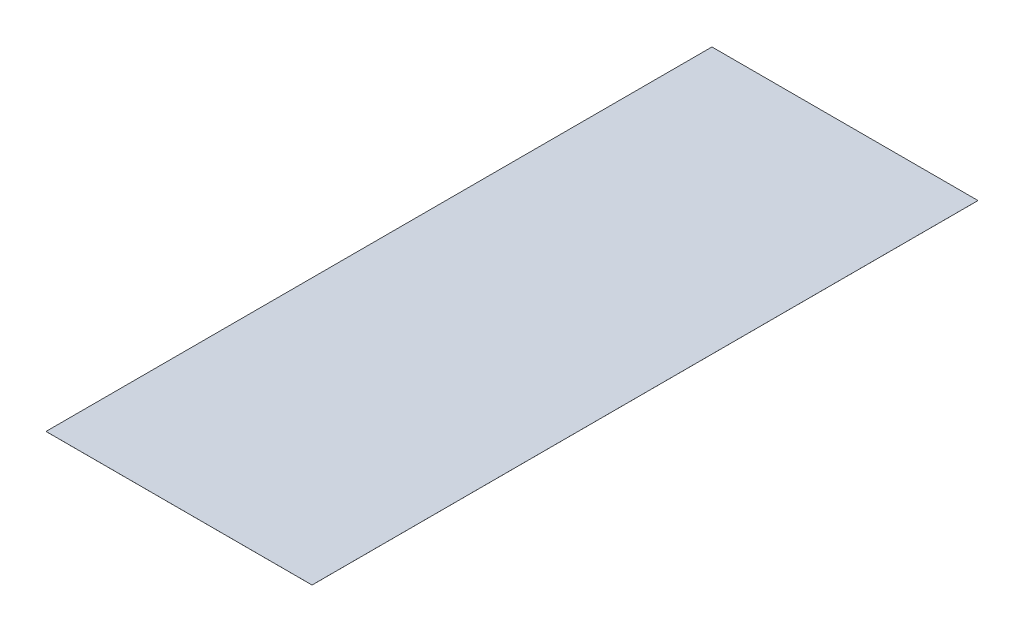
ISO-10303-21;
HEADER;
FILE_DESCRIPTION(('STEP AP214'),'2;1');
FILE_NAME('part.step','',(''),(''),'','','');
FILE_SCHEMA(('AUTOMOTIVE_DESIGN { 1 0 10303 214 1 1 1 1 }'));
ENDSEC;
DATA;
#1=APPLICATION_CONTEXT('core data for automotive mechanical design processes');
#2=APPLICATION_PROTOCOL_DEFINITION('international standard','automotive_design',2000,#1);
#3=PRODUCT_CONTEXT('',#1,'mechanical');
#4=PRODUCT('Part','Part','',(#3));
#5=PRODUCT_RELATED_PRODUCT_CATEGORY('part','',(#4));
#6=PRODUCT_DEFINITION_FORMATION('','',#4);
#7=PRODUCT_DEFINITION_CONTEXT('part definition',#1,'design');
#8=PRODUCT_DEFINITION('design','',#6,#7);
#9=PRODUCT_DEFINITION_SHAPE('','',#8);
#10=(LENGTH_UNIT() NAMED_UNIT(*) SI_UNIT(.MILLI.,.METRE.));
#11=(NAMED_UNIT(*) PLANE_ANGLE_UNIT() SI_UNIT($,.RADIAN.));
#12=(NAMED_UNIT(*) SI_UNIT($,.STERADIAN.) SOLID_ANGLE_UNIT());
#13=UNCERTAINTY_MEASURE_WITH_UNIT(LENGTH_MEASURE(1.E-05),#10,'distance_accuracy_value','');
#14=(GEOMETRIC_REPRESENTATION_CONTEXT(3) GLOBAL_UNCERTAINTY_ASSIGNED_CONTEXT((#13)) GLOBAL_UNIT_ASSIGNED_CONTEXT((#10,
#11,#12)) REPRESENTATION_CONTEXT('',''));
#15=CARTESIAN_POINT('',(0.,0.,0.));
#16=DIRECTION('',(0.,0.,1.));
#17=DIRECTION('',(1.,0.,0.));
#18=AXIS2_PLACEMENT_3D('',#15,#16,#17);
#19=CARTESIAN_POINT('',(-2000.,0.49999999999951,10012.49));
#20=DIRECTION('',(1.,0.,0.));
#21=DIRECTION('',(0.,0.,-1.));
#22=AXIS2_PLACEMENT_3D('',#19,#20,#21);
#23=PLANE('',#22);
#24=DIRECTION('',(0.,-1.,0.));
#25=VECTOR('',#24,1.);
#26=CARTESIAN_POINT('',(-2000.,0.49999999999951,0.));
#27=LINE('',#26,#25);
#28=CARTESIAN_POINT('',(-2000.,0.49999999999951,0.));
#29=VERTEX_POINT('',#28);
#30=CARTESIAN_POINT('',(-2000.,0.,0.));
#31=VERTEX_POINT('',#30);
#32=EDGE_CURVE('E101',#29,#31,#27,.T.);
#33=ORIENTED_EDGE('',*,*,#32,.T.);
#34=DIRECTION('',(0.,0.,-1.));
#35=VECTOR('',#34,1.);
#36=CARTESIAN_POINT('',(-2000.,0.,10012.49));
#37=LINE('',#36,#35);
#38=CARTESIAN_POINT('',(-2000.,0.,10012.49));
#39=VERTEX_POINT('',#38);
#40=EDGE_CURVE('E11',#39,#31,#37,.T.);
#41=ORIENTED_EDGE('',*,*,#40,.F.);
#42=DIRECTION('',(0.,-1.,0.));
#43=VECTOR('',#42,1.);
#44=CARTESIAN_POINT('',(-2000.,0.49999999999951,10012.49));
#45=LINE('',#44,#43);
#46=CARTESIAN_POINT('',(-2000.,0.49999999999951,10012.49));
#47=VERTEX_POINT('',#46);
#48=EDGE_CURVE('E89',#47,#39,#45,.T.);
#49=ORIENTED_EDGE('',*,*,#48,.F.);
#50=DIRECTION('',(0.,0.,-1.));
#51=VECTOR('',#50,1.);
#52=CARTESIAN_POINT('',(-2000.,0.49999999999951,10012.49));
#53=LINE('',#52,#51);
#54=EDGE_CURVE('E97',#47,#29,#53,.T.);
#55=ORIENTED_EDGE('',*,*,#54,.T.);
#56=EDGE_LOOP('',(#33,#41,#49,#55));
#57=FACE_BOUND('',#56,.T.);
#58=ADVANCED_FACE('F38',(#57),#23,.F.);
#59=CARTESIAN_POINT('',(-2000.,0.,10012.49));
#60=DIRECTION('',(0.,1.,0.));
#61=DIRECTION('',(-1.,0.,0.));
#62=AXIS2_PLACEMENT_3D('',#59,#60,#61);
#63=PLANE('',#62);
#64=DIRECTION('',(1.,0.,0.));
#65=VECTOR('',#64,1.);
#66=CARTESIAN_POINT('',(-2000.,0.,0.));
#67=LINE('',#66,#65);
#68=CARTESIAN_POINT('',(2000.,0.,0.));
#69=VERTEX_POINT('',#68);
#70=EDGE_CURVE('E93',#31,#69,#67,.T.);
#71=ORIENTED_EDGE('',*,*,#70,.T.);
#72=DIRECTION('',(0.,0.,-1.));
#73=VECTOR('',#72,1.);
#74=CARTESIAN_POINT('',(2000.,0.,10012.49));
#75=LINE('',#74,#73);
#76=CARTESIAN_POINT('',(2000.,0.,10012.49));
#77=VERTEX_POINT('',#76);
#78=EDGE_CURVE('E46',#77,#69,#75,.T.);
#79=ORIENTED_EDGE('',*,*,#78,.F.);
#80=DIRECTION('',(1.,0.,0.));
#81=VECTOR('',#80,1.);
#82=CARTESIAN_POINT('',(-2000.,0.,10012.49));
#83=LINE('',#82,#81);
#84=EDGE_CURVE('E84',#39,#77,#83,.T.);
#85=ORIENTED_EDGE('',*,*,#84,.F.);
#86=ORIENTED_EDGE('',*,*,#40,.T.);
#87=EDGE_LOOP('',(#71,#79,#85,#86));
#88=FACE_BOUND('',#87,.T.);
#89=ADVANCED_FACE('F92',(#88),#63,.F.);
#90=CARTESIAN_POINT('',(2000.,0.,10012.49));
#91=DIRECTION('',(-1.,0.,0.));
#92=DIRECTION('',(0.,0.,1.));
#93=AXIS2_PLACEMENT_3D('',#90,#91,#92);
#94=PLANE('',#93);
#95=DIRECTION('',(0.,1.,0.));
#96=VECTOR('',#95,1.);
#97=CARTESIAN_POINT('',(2000.,0.,0.));
#98=LINE('',#97,#96);
#99=CARTESIAN_POINT('',(2000.,0.5,0.));
#100=VERTEX_POINT('',#99);
#101=EDGE_CURVE('E71',#69,#100,#98,.T.);
#102=ORIENTED_EDGE('',*,*,#101,.T.);
#103=DIRECTION('',(0.,0.,-1.));
#104=VECTOR('',#103,1.);
#105=CARTESIAN_POINT('',(2000.,0.5,10012.49));
#106=LINE('',#105,#104);
#107=CARTESIAN_POINT('',(2000.,0.5,10012.49));
#108=VERTEX_POINT('',#107);
#109=EDGE_CURVE('E94',#108,#100,#106,.T.);
#110=ORIENTED_EDGE('',*,*,#109,.F.);
#111=DIRECTION('',(0.,1.,0.));
#112=VECTOR('',#111,1.);
#113=CARTESIAN_POINT('',(2000.,0.,10012.49));
#114=LINE('',#113,#112);
#115=EDGE_CURVE('E87',#77,#108,#114,.T.);
#116=ORIENTED_EDGE('',*,*,#115,.F.);
#117=ORIENTED_EDGE('',*,*,#78,.T.);
#118=EDGE_LOOP('',(#102,#110,#116,#117));
#119=FACE_BOUND('',#118,.T.);
#120=ADVANCED_FACE('F95',(#119),#94,.F.);
#121=CARTESIAN_POINT('',(2000.,0.5,10012.49));
#122=DIRECTION('',(0.,-1.,0.));
#123=DIRECTION('',(1.,0.,0.));
#124=AXIS2_PLACEMENT_3D('',#121,#122,#123);
#125=PLANE('',#124);
#126=DIRECTION('',(-1.,0.,0.));
#127=VECTOR('',#126,1.);
#128=CARTESIAN_POINT('',(2000.,0.5,0.));
#129=LINE('',#128,#127);
#130=EDGE_CURVE('E77',#100,#29,#129,.T.);
#131=ORIENTED_EDGE('',*,*,#130,.T.);
#132=ORIENTED_EDGE('',*,*,#54,.F.);
#133=DIRECTION('',(-1.,0.,0.));
#134=VECTOR('',#133,1.);
#135=CARTESIAN_POINT('',(2000.,0.5,10012.49));
#136=LINE('',#135,#134);
#137=EDGE_CURVE('E54',#108,#47,#136,.T.);
#138=ORIENTED_EDGE('',*,*,#137,.F.);
#139=ORIENTED_EDGE('',*,*,#109,.T.);
#140=EDGE_LOOP('',(#131,#132,#138,#139));
#141=FACE_BOUND('',#140,.T.);
#142=ADVANCED_FACE('F108',(#141),#125,.F.);
#143=CARTESIAN_POINT('',(-2000.,0.,10012.49));
#144=DIRECTION('',(0.,0.,1.));
#145=DIRECTION('',(1.,0.,0.));
#146=AXIS2_PLACEMENT_3D('',#143,#144,#145);
#147=PLANE('',#146);
#148=ORIENTED_EDGE('',*,*,#48,.T.);
#149=ORIENTED_EDGE('',*,*,#84,.T.);
#150=ORIENTED_EDGE('',*,*,#115,.T.);
#151=ORIENTED_EDGE('',*,*,#137,.T.);
#152=EDGE_LOOP('',(#148,#149,#150,#151));
#153=FACE_BOUND('',#152,.T.);
#154=ADVANCED_FACE('F85',(#153),#147,.T.);
#155=CARTESIAN_POINT('',(-2000.,0.,0.));
#156=DIRECTION('',(0.,0.,1.));
#157=DIRECTION('',(1.,0.,0.));
#158=AXIS2_PLACEMENT_3D('',#155,#156,#157);
#159=PLANE('',#158);
#160=ORIENTED_EDGE('',*,*,#32,.F.);
#161=ORIENTED_EDGE('',*,*,#130,.F.);
#162=ORIENTED_EDGE('',*,*,#101,.F.);
#163=ORIENTED_EDGE('',*,*,#70,.F.);
#164=EDGE_LOOP('',(#160,#161,#162,#163));
#165=FACE_BOUND('',#164,.T.);
#166=ADVANCED_FACE('F111',(#165),#159,.F.);
#167=CLOSED_SHELL('',(#58,#89,#120,#142,#154,#166));
#168=MANIFOLD_SOLID_BREP('B2',#167);
#169=ADVANCED_BREP_SHAPE_REPRESENTATION('',(#18,#168),#14);
#170=SHAPE_DEFINITION_REPRESENTATION(#9,#169);
ENDSEC;
END-ISO-10303-21;
